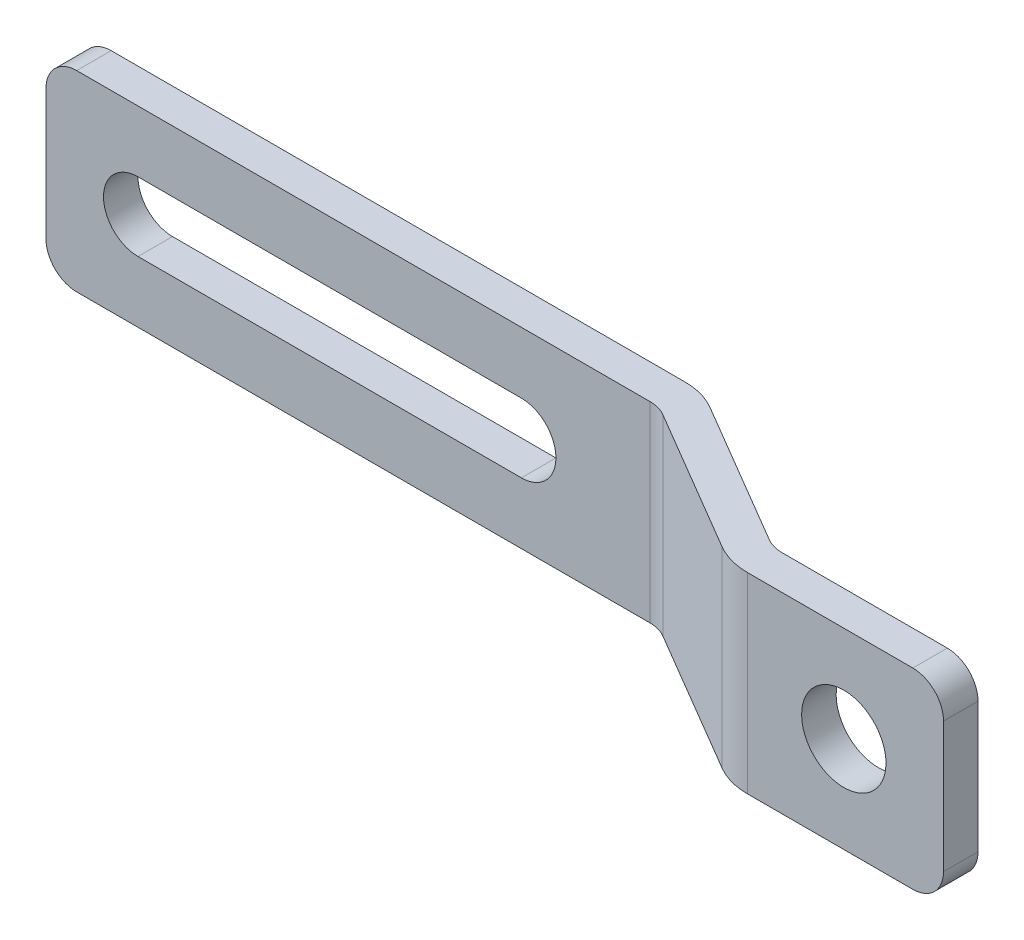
ISO-10303-21;
HEADER;
FILE_DESCRIPTION(('STEP AP214'),'2;1');
FILE_NAME('part.step','',(''),(''),'','','');
FILE_SCHEMA(('AUTOMOTIVE_DESIGN { 1 0 10303 214 1 1 1 1 }'));
ENDSEC;
DATA;
#1=APPLICATION_CONTEXT('core data for automotive mechanical design processes');
#2=APPLICATION_PROTOCOL_DEFINITION('international standard','automotive_design',2000,#1);
#3=PRODUCT_CONTEXT('',#1,'mechanical');
#4=PRODUCT('Part','Part','',(#3));
#5=PRODUCT_RELATED_PRODUCT_CATEGORY('part','',(#4));
#6=PRODUCT_DEFINITION_FORMATION('','',#4);
#7=PRODUCT_DEFINITION_CONTEXT('part definition',#1,'design');
#8=PRODUCT_DEFINITION('design','',#6,#7);
#9=PRODUCT_DEFINITION_SHAPE('','',#8);
#10=(LENGTH_UNIT() NAMED_UNIT(*) SI_UNIT(.MILLI.,.METRE.));
#11=(NAMED_UNIT(*) PLANE_ANGLE_UNIT() SI_UNIT($,.RADIAN.));
#12=(NAMED_UNIT(*) SI_UNIT($,.STERADIAN.) SOLID_ANGLE_UNIT());
#13=UNCERTAINTY_MEASURE_WITH_UNIT(LENGTH_MEASURE(1.E-05),#10,'distance_accuracy_value','');
#14=(GEOMETRIC_REPRESENTATION_CONTEXT(3) GLOBAL_UNCERTAINTY_ASSIGNED_CONTEXT((#13)) GLOBAL_UNIT_ASSIGNED_CONTEXT((#10,
#11,#12)) REPRESENTATION_CONTEXT('',''));
#15=CARTESIAN_POINT('',(0.,0.,0.));
#16=DIRECTION('',(0.,0.,1.));
#17=DIRECTION('',(1.,0.,0.));
#18=AXIS2_PLACEMENT_3D('',#15,#16,#17);
#19=CARTESIAN_POINT('',(16.7735810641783,12.5,4.5));
#20=DIRECTION('',(0.,0.,1.));
#21=DIRECTION('',(1.,0.,0.));
#22=AXIS2_PLACEMENT_3D('',#19,#20,#21);
#23=PLANE('',#22);
#24=DIRECTION('',(-1.,0.,0.));
#25=VECTOR('',#24,1.);
#26=CARTESIAN_POINT('',(16.7735810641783,12.5,4.5));
#27=LINE('',#26,#25);
#28=CARTESIAN_POINT('',(16.7735810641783,12.5,4.5));
#29=VERTEX_POINT('',#28);
#30=CARTESIAN_POINT('',(-58.,12.5,4.5));
#31=VERTEX_POINT('',#30);
#32=EDGE_CURVE('E224',#29,#31,#27,.T.);
#33=ORIENTED_EDGE('',*,*,#32,.T.);
#34=CARTESIAN_POINT('',(-58.,8.5,4.5));
#35=DIRECTION('',(0.,0.,1.));
#36=DIRECTION('',(1.,0.,0.));
#37=AXIS2_PLACEMENT_3D('',#34,#35,#36);
#38=CIRCLE('',#37,4.);
#39=CARTESIAN_POINT('',(-62.,8.5,4.5));
#40=VERTEX_POINT('',#39);
#41=EDGE_CURVE('E290',#31,#40,#38,.T.);
#42=ORIENTED_EDGE('',*,*,#41,.T.);
#43=DIRECTION('',(0.,-1.,0.));
#44=VECTOR('',#43,1.);
#45=CARTESIAN_POINT('',(-62.,12.5,4.5));
#46=LINE('',#45,#44);
#47=CARTESIAN_POINT('',(-62.,-8.5,4.5));
#48=VERTEX_POINT('',#47);
#49=EDGE_CURVE('E278',#40,#48,#46,.T.);
#50=ORIENTED_EDGE('',*,*,#49,.T.);
#51=CARTESIAN_POINT('',(-58.,-8.5,4.5));
#52=DIRECTION('',(0.,0.,1.));
#53=DIRECTION('',(1.,0.,0.));
#54=AXIS2_PLACEMENT_3D('',#51,#52,#53);
#55=CIRCLE('',#54,4.);
#56=CARTESIAN_POINT('',(-58.,-12.5,4.5));
#57=VERTEX_POINT('',#56);
#58=EDGE_CURVE('E288',#48,#57,#55,.T.);
#59=ORIENTED_EDGE('',*,*,#58,.T.);
#60=DIRECTION('',(-1.,0.,0.));
#61=VECTOR('',#60,1.);
#62=CARTESIAN_POINT('',(16.7735810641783,-12.5,4.5));
#63=LINE('',#62,#61);
#64=CARTESIAN_POINT('',(16.7735810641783,-12.5,4.5));
#65=VERTEX_POINT('',#64);
#66=EDGE_CURVE('E196',#65,#57,#63,.T.);
#67=ORIENTED_EDGE('',*,*,#66,.F.);
#68=DIRECTION('',(0.,-1.,0.));
#69=VECTOR('',#68,1.);
#70=CARTESIAN_POINT('',(16.7735810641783,12.5,4.5));
#71=LINE('',#70,#69);
#72=EDGE_CURVE('E276',#29,#65,#71,.T.);
#73=ORIENTED_EDGE('',*,*,#72,.F.);
#74=EDGE_LOOP('',(#33,#42,#50,#59,#67,#73));
#75=FACE_BOUND('',#74,.T.);
#76=DIRECTION('',(1.,0.,0.));
#77=VECTOR('',#76,1.);
#78=CARTESIAN_POINT('',(16.7735810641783,-4.5,4.5));
#79=LINE('',#78,#77);
#80=CARTESIAN_POINT('',(-50.,-4.5,4.5));
#81=VERTEX_POINT('',#80);
#82=CARTESIAN_POINT('',(0.,-4.5,4.5));
#83=VERTEX_POINT('',#82);
#84=EDGE_CURVE('E163',#81,#83,#79,.T.);
#85=ORIENTED_EDGE('',*,*,#84,.F.);
#86=CARTESIAN_POINT('',(-50.,0.,4.5));
#87=DIRECTION('',(0.,0.,1.));
#88=DIRECTION('',(1.,0.,0.));
#89=AXIS2_PLACEMENT_3D('',#86,#87,#88);
#90=CIRCLE('',#89,4.5);
#91=CARTESIAN_POINT('',(-50.,4.5,4.5));
#92=VERTEX_POINT('',#91);
#93=EDGE_CURVE('E190',#81,#92,#90,.F.);
#94=ORIENTED_EDGE('',*,*,#93,.T.);
#95=DIRECTION('',(1.,0.,0.));
#96=VECTOR('',#95,1.);
#97=CARTESIAN_POINT('',(16.7735810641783,4.5,4.5));
#98=LINE('',#97,#96);
#99=CARTESIAN_POINT('',(0.,4.5,4.5));
#100=VERTEX_POINT('',#99);
#101=EDGE_CURVE('E159',#92,#100,#98,.T.);
#102=ORIENTED_EDGE('',*,*,#101,.T.);
#103=CARTESIAN_POINT('',(0.,0.,4.5));
#104=DIRECTION('',(0.,0.,1.));
#105=DIRECTION('',(1.,0.,0.));
#106=AXIS2_PLACEMENT_3D('',#103,#104,#105);
#107=CIRCLE('',#106,4.5);
#108=EDGE_CURVE('E187',#83,#100,#107,.T.);
#109=ORIENTED_EDGE('',*,*,#108,.F.);
#110=EDGE_LOOP('',(#85,#94,#102,#109));
#111=FACE_BOUND('',#110,.T.);
#112=ADVANCED_FACE('F14',(#75,#111),#23,.T.);
#113=CARTESIAN_POINT('',(16.7735810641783,12.5,0.));
#114=DIRECTION('',(0.,0.,1.));
#115=DIRECTION('',(1.,0.,0.));
#116=AXIS2_PLACEMENT_3D('',#113,#114,#115);
#117=PLANE('',#116);
#118=DIRECTION('',(0.,-1.,0.));
#119=VECTOR('',#118,1.);
#120=CARTESIAN_POINT('',(-62.,12.5,0.));
#121=LINE('',#120,#119);
#122=CARTESIAN_POINT('',(-62.,8.5,0.));
#123=VERTEX_POINT('',#122);
#124=CARTESIAN_POINT('',(-62.,-8.5,0.));
#125=VERTEX_POINT('',#124);
#126=EDGE_CURVE('E252',#123,#125,#121,.T.);
#127=ORIENTED_EDGE('',*,*,#126,.F.);
#128=CARTESIAN_POINT('',(-58.,8.5,0.));
#129=DIRECTION('',(0.,0.,1.));
#130=DIRECTION('',(1.,0.,0.));
#131=AXIS2_PLACEMENT_3D('',#128,#129,#130);
#132=CIRCLE('',#131,4.);
#133=CARTESIAN_POINT('',(-58.,12.5,0.));
#134=VERTEX_POINT('',#133);
#135=EDGE_CURVE('E299',#123,#134,#132,.F.);
#136=ORIENTED_EDGE('',*,*,#135,.T.);
#137=DIRECTION('',(-1.,0.,0.));
#138=VECTOR('',#137,1.);
#139=CARTESIAN_POINT('',(16.7735810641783,12.5,0.));
#140=LINE('',#139,#138);
#141=CARTESIAN_POINT('',(16.7735810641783,12.5,0.));
#142=VERTEX_POINT('',#141);
#143=EDGE_CURVE('E249',#142,#134,#140,.T.);
#144=ORIENTED_EDGE('',*,*,#143,.F.);
#145=DIRECTION('',(0.,-1.,0.));
#146=VECTOR('',#145,1.);
#147=CARTESIAN_POINT('',(16.7735810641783,12.5,0.));
#148=LINE('',#147,#146);
#149=CARTESIAN_POINT('',(16.7735810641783,-12.5,0.));
#150=VERTEX_POINT('',#149);
#151=EDGE_CURVE('E255',#142,#150,#148,.T.);
#152=ORIENTED_EDGE('',*,*,#151,.T.);
#153=DIRECTION('',(-1.,0.,0.));
#154=VECTOR('',#153,1.);
#155=CARTESIAN_POINT('',(16.7735810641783,-12.5,0.));
#156=LINE('',#155,#154);
#157=CARTESIAN_POINT('',(-58.,-12.5,0.));
#158=VERTEX_POINT('',#157);
#159=EDGE_CURVE('E221',#150,#158,#156,.T.);
#160=ORIENTED_EDGE('',*,*,#159,.T.);
#161=CARTESIAN_POINT('',(-58.,-8.5,0.));
#162=DIRECTION('',(0.,0.,1.));
#163=DIRECTION('',(1.,0.,0.));
#164=AXIS2_PLACEMENT_3D('',#161,#162,#163);
#165=CIRCLE('',#164,4.);
#166=EDGE_CURVE('E297',#158,#125,#165,.F.);
#167=ORIENTED_EDGE('',*,*,#166,.T.);
#168=EDGE_LOOP('',(#127,#136,#144,#152,#160,#167));
#169=FACE_BOUND('',#168,.T.);
#170=CARTESIAN_POINT('',(-50.,0.,0.));
#171=DIRECTION('',(0.,0.,-1.));
#172=DIRECTION('',(0.,-1.,0.));
#173=AXIS2_PLACEMENT_3D('',#170,#171,#172);
#174=CIRCLE('',#173,4.5);
#175=CARTESIAN_POINT('',(-50.,-4.5,0.));
#176=VERTEX_POINT('',#175);
#177=CARTESIAN_POINT('',(-50.,4.5,0.));
#178=VERTEX_POINT('',#177);
#179=EDGE_CURVE('E167',#176,#178,#174,.T.);
#180=ORIENTED_EDGE('',*,*,#179,.F.);
#181=DIRECTION('',(1.,0.,0.));
#182=VECTOR('',#181,1.);
#183=CARTESIAN_POINT('',(-50.,-4.5,0.));
#184=LINE('',#183,#182);
#185=CARTESIAN_POINT('',(0.,-4.5,0.));
#186=VERTEX_POINT('',#185);
#187=EDGE_CURVE('E177',#176,#186,#184,.T.);
#188=ORIENTED_EDGE('',*,*,#187,.T.);
#189=CARTESIAN_POINT('',(0.,0.,0.));
#190=DIRECTION('',(0.,0.,1.));
#191=DIRECTION('',(0.,1.,0.));
#192=AXIS2_PLACEMENT_3D('',#189,#190,#191);
#193=CIRCLE('',#192,4.5);
#194=CARTESIAN_POINT('',(0.,4.5,0.));
#195=VERTEX_POINT('',#194);
#196=EDGE_CURVE('E175',#186,#195,#193,.T.);
#197=ORIENTED_EDGE('',*,*,#196,.T.);
#198=DIRECTION('',(1.,0.,0.));
#199=VECTOR('',#198,1.);
#200=CARTESIAN_POINT('',(-50.,4.5,0.));
#201=LINE('',#200,#199);
#202=EDGE_CURVE('E156',#178,#195,#201,.T.);
#203=ORIENTED_EDGE('',*,*,#202,.F.);
#204=EDGE_LOOP('',(#180,#188,#197,#203));
#205=FACE_BOUND('',#204,.T.);
#206=ADVANCED_FACE('F174',(#169,#205),#117,.F.);
#207=CARTESIAN_POINT('',(-62.,12.5,0.));
#208=DIRECTION('',(1.,0.,0.));
#209=DIRECTION('',(0.,0.,-1.));
#210=AXIS2_PLACEMENT_3D('',#207,#208,#209);
#211=PLANE('',#210);
#212=ORIENTED_EDGE('',*,*,#49,.F.);
#213=DIRECTION('',(0.,0.,1.));
#214=VECTOR('',#213,1.);
#215=CARTESIAN_POINT('',(-62.,8.5,8.99999999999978));
#216=LINE('',#215,#214);
#217=EDGE_CURVE('E295',#40,#123,#216,.F.);
#218=ORIENTED_EDGE('',*,*,#217,.T.);
#219=ORIENTED_EDGE('',*,*,#126,.T.);
#220=DIRECTION('',(0.,0.,1.));
#221=VECTOR('',#220,1.);
#222=CARTESIAN_POINT('',(-62.,-8.5,0.));
#223=LINE('',#222,#221);
#224=EDGE_CURVE('E292',#125,#48,#223,.T.);
#225=ORIENTED_EDGE('',*,*,#224,.T.);
#226=EDGE_LOOP('',(#212,#218,#219,#225));
#227=FACE_BOUND('',#226,.T.);
#228=ADVANCED_FACE('F326',(#227),#211,.F.);
#229=CARTESIAN_POINT('',(16.7735810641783,12.5,9.));
#230=DIRECTION('',(0.,-1.,0.));
#231=DIRECTION('',(1.,0.,0.));
#232=AXIS2_PLACEMENT_3D('',#229,#230,#231);
#233=CYLINDRICAL_SURFACE('',#232,4.5);
#234=DIRECTION('',(0.,-1.,0.));
#235=VECTOR('',#234,1.);
#236=CARTESIAN_POINT('',(19.0568269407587,12.5,5.12227021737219));
#237=LINE('',#236,#235);
#238=CARTESIAN_POINT('',(19.0568269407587,12.5,5.12227021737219));
#239=VERTEX_POINT('',#238);
#240=CARTESIAN_POINT('',(19.0568269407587,-12.5,5.12227021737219));
#241=VERTEX_POINT('',#240);
#242=EDGE_CURVE('E274',#239,#241,#237,.T.);
#243=ORIENTED_EDGE('',*,*,#242,.F.);
#244=CARTESIAN_POINT('',(16.7735810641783,12.5,9.));
#245=DIRECTION('',(0.,1.,0.));
#246=DIRECTION('',(-1.,0.,0.));
#247=AXIS2_PLACEMENT_3D('',#244,#245,#246);
#248=CIRCLE('',#247,4.5);
#249=EDGE_CURVE('E227',#239,#29,#248,.T.);
#250=ORIENTED_EDGE('',*,*,#249,.T.);
#251=ORIENTED_EDGE('',*,*,#72,.T.);
#252=CARTESIAN_POINT('',(16.7735810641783,-12.5,9.));
#253=DIRECTION('',(0.,1.,0.));
#254=DIRECTION('',(-1.,0.,0.));
#255=AXIS2_PLACEMENT_3D('',#252,#253,#254);
#256=CIRCLE('',#255,4.5);
#257=EDGE_CURVE('E199',#241,#65,#256,.T.);
#258=ORIENTED_EDGE('',*,*,#257,.F.);
#259=EDGE_LOOP('',(#243,#250,#251,#258));
#260=FACE_BOUND('',#259,.T.);
#261=ADVANCED_FACE('F377',(#260),#233,.F.);
#262=CARTESIAN_POINT('',(37.8863461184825,12.5,16.2092784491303));
#263=DIRECTION('',(-0.507387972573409,0.,0.861717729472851));
#264=DIRECTION('',(0.861717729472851,0.,0.507387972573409));
#265=AXIS2_PLACEMENT_3D('',#262,#263,#264);
#266=PLANE('',#265);
#267=DIRECTION('',(0.,-1.,0.));
#268=VECTOR('',#267,1.);
#269=CARTESIAN_POINT('',(37.8863461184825,12.5,16.2092784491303));
#270=LINE('',#269,#268);
#271=CARTESIAN_POINT('',(37.8863461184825,12.5,16.2092784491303));
#272=VERTEX_POINT('',#271);
#273=CARTESIAN_POINT('',(37.8863461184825,-12.5,16.2092784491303));
#274=VERTEX_POINT('',#273);
#275=EDGE_CURVE('E272',#272,#274,#270,.T.);
#276=ORIENTED_EDGE('',*,*,#275,.F.);
#277=DIRECTION('',(-0.861717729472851,0.,-0.507387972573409));
#278=VECTOR('',#277,1.);
#279=CARTESIAN_POINT('',(37.8863461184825,12.5,16.2092784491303));
#280=LINE('',#279,#278);
#281=EDGE_CURVE('E230',#272,#239,#280,.T.);
#282=ORIENTED_EDGE('',*,*,#281,.T.);
#283=ORIENTED_EDGE('',*,*,#242,.T.);
#284=DIRECTION('',(-0.861717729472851,0.,-0.507387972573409));
#285=VECTOR('',#284,1.);
#286=CARTESIAN_POINT('',(37.8863461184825,-12.5,16.2092784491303));
#287=LINE('',#286,#285);
#288=EDGE_CURVE('E202',#274,#241,#287,.T.);
#289=ORIENTED_EDGE('',*,*,#288,.F.);
#290=EDGE_LOOP('',(#276,#282,#283,#289));
#291=FACE_BOUND('',#290,.T.);
#292=ADVANCED_FACE('F374',(#291),#266,.T.);
#293=CARTESIAN_POINT('',(42.4528378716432,12.5,8.45381888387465));
#294=DIRECTION('',(0.,-1.,0.));
#295=DIRECTION('',(1.,0.,0.));
#296=AXIS2_PLACEMENT_3D('',#293,#294,#295);
#297=CYLINDRICAL_SURFACE('',#296,9.);
#298=DIRECTION('',(0.,-1.,0.));
#299=VECTOR('',#298,1.);
#300=CARTESIAN_POINT('',(42.4528378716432,12.5,17.4538188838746));
#301=LINE('',#300,#299);
#302=CARTESIAN_POINT('',(42.4528378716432,12.5,17.4538188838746));
#303=VERTEX_POINT('',#302);
#304=CARTESIAN_POINT('',(42.4528378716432,-12.5,17.4538188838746));
#305=VERTEX_POINT('',#304);
#306=EDGE_CURVE('E269',#303,#305,#301,.T.);
#307=ORIENTED_EDGE('',*,*,#306,.F.);
#308=CARTESIAN_POINT('',(42.4528378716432,12.5,8.45381888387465));
#309=DIRECTION('',(0.,-1.,0.));
#310=DIRECTION('',(1.,0.,0.));
#311=AXIS2_PLACEMENT_3D('',#308,#309,#310);
#312=CIRCLE('',#311,9.);
#313=EDGE_CURVE('E233',#303,#272,#312,.T.);
#314=ORIENTED_EDGE('',*,*,#313,.T.);
#315=ORIENTED_EDGE('',*,*,#275,.T.);
#316=CARTESIAN_POINT('',(42.4528378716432,-12.5,8.45381888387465));
#317=DIRECTION('',(0.,-1.,0.));
#318=DIRECTION('',(1.,0.,0.));
#319=AXIS2_PLACEMENT_3D('',#316,#317,#318);
#320=CIRCLE('',#319,9.);
#321=EDGE_CURVE('E205',#305,#274,#320,.T.);
#322=ORIENTED_EDGE('',*,*,#321,.F.);
#323=EDGE_LOOP('',(#307,#314,#315,#322));
#324=FACE_BOUND('',#323,.T.);
#325=ADVANCED_FACE('F370',(#324),#297,.T.);
#326=CARTESIAN_POINT('',(68.,12.5,17.4538188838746));
#327=DIRECTION('',(0.,0.,1.));
#328=DIRECTION('',(0.,1.,0.));
#329=AXIS2_PLACEMENT_3D('',#326,#327,#328);
#330=PLANE('',#329);
#331=CARTESIAN_POINT('',(55.,0.,17.4538188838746));
#332=DIRECTION('',(0.,0.,1.));
#333=DIRECTION('',(0.,1.,0.));
#334=AXIS2_PLACEMENT_3D('',#331,#332,#333);
#335=CIRCLE('',#334,5.5);
#336=CARTESIAN_POINT('',(55.,5.5,17.4538188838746));
#337=VERTEX_POINT('',#336);
#338=EDGE_CURVE('E192',#337,#337,#335,.T.);
#339=ORIENTED_EDGE('',*,*,#338,.F.);
#340=EDGE_LOOP('',(#339));
#341=FACE_BOUND('',#340,.T.);
#342=DIRECTION('',(0.,-1.,0.));
#343=VECTOR('',#342,1.);
#344=CARTESIAN_POINT('',(68.,12.5,17.4538188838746));
#345=LINE('',#344,#343);
#346=CARTESIAN_POINT('',(68.,8.5,17.4538188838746));
#347=VERTEX_POINT('',#346);
#348=CARTESIAN_POINT('',(68.,-8.5,17.4538188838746));
#349=VERTEX_POINT('',#348);
#350=EDGE_CURVE('E266',#347,#349,#345,.T.);
#351=ORIENTED_EDGE('',*,*,#350,.F.);
#352=CARTESIAN_POINT('',(64.,8.5,17.4538188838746));
#353=DIRECTION('',(0.,0.,1.));
#354=DIRECTION('',(0.,1.,0.));
#355=AXIS2_PLACEMENT_3D('',#352,#353,#354);
#356=CIRCLE('',#355,4.);
#357=CARTESIAN_POINT('',(64.,12.5,17.4538188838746));
#358=VERTEX_POINT('',#357);
#359=EDGE_CURVE('E307',#347,#358,#356,.T.);
#360=ORIENTED_EDGE('',*,*,#359,.T.);
#361=DIRECTION('',(-1.,0.,0.));
#362=VECTOR('',#361,1.);
#363=CARTESIAN_POINT('',(68.,12.5,17.4538188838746));
#364=LINE('',#363,#362);
#365=EDGE_CURVE('E236',#358,#303,#364,.T.);
#366=ORIENTED_EDGE('',*,*,#365,.T.);
#367=ORIENTED_EDGE('',*,*,#306,.T.);
#368=DIRECTION('',(-1.,0.,0.));
#369=VECTOR('',#368,1.);
#370=CARTESIAN_POINT('',(68.,-12.5,17.4538188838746));
#371=LINE('',#370,#369);
#372=CARTESIAN_POINT('',(64.,-12.5,17.4538188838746));
#373=VERTEX_POINT('',#372);
#374=EDGE_CURVE('E208',#373,#305,#371,.T.);
#375=ORIENTED_EDGE('',*,*,#374,.F.);
#376=CARTESIAN_POINT('',(64.,-8.5,17.4538188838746));
#377=DIRECTION('',(0.,0.,1.));
#378=DIRECTION('',(0.,1.,0.));
#379=AXIS2_PLACEMENT_3D('',#376,#377,#378);
#380=CIRCLE('',#379,4.);
#381=EDGE_CURVE('E36',#373,#349,#380,.T.);
#382=ORIENTED_EDGE('',*,*,#381,.T.);
#383=EDGE_LOOP('',(#351,#360,#366,#367,#375,#382));
#384=FACE_BOUND('',#383,.T.);
#385=ADVANCED_FACE('F364',(#341,#384),#330,.T.);
#386=CARTESIAN_POINT('',(68.,12.5,12.9538188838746));
#387=DIRECTION('',(1.,0.,0.));
#388=DIRECTION('',(0.,1.,0.));
#389=AXIS2_PLACEMENT_3D('',#386,#387,#388);
#390=PLANE('',#389);
#391=DIRECTION('',(0.,-1.,0.));
#392=VECTOR('',#391,1.);
#393=CARTESIAN_POINT('',(68.,12.5,12.9538188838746));
#394=LINE('',#393,#392);
#395=CARTESIAN_POINT('',(68.,8.5,12.9538188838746));
#396=VERTEX_POINT('',#395);
#397=CARTESIAN_POINT('',(68.,-8.5,12.9538188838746));
#398=VERTEX_POINT('',#397);
#399=EDGE_CURVE('E264',#396,#398,#394,.T.);
#400=ORIENTED_EDGE('',*,*,#399,.F.);
#401=DIRECTION('',(0.,0.,1.));
#402=VECTOR('',#401,1.);
#403=CARTESIAN_POINT('',(68.,8.5,12.9538188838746));
#404=LINE('',#403,#402);
#405=EDGE_CURVE('E303',#396,#347,#404,.T.);
#406=ORIENTED_EDGE('',*,*,#405,.T.);
#407=ORIENTED_EDGE('',*,*,#350,.T.);
#408=DIRECTION('',(0.,0.,1.));
#409=VECTOR('',#408,1.);
#410=CARTESIAN_POINT('',(68.,-8.5,9.));
#411=LINE('',#410,#409);
#412=EDGE_CURVE('E301',#349,#398,#411,.F.);
#413=ORIENTED_EDGE('',*,*,#412,.T.);
#414=EDGE_LOOP('',(#400,#406,#407,#413));
#415=FACE_BOUND('',#414,.T.);
#416=ADVANCED_FACE('F357',(#415),#390,.T.);
#417=CARTESIAN_POINT('',(68.,12.5,12.9538188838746));
#418=DIRECTION('',(0.,0.,1.));
#419=DIRECTION('',(0.,1.,0.));
#420=AXIS2_PLACEMENT_3D('',#417,#418,#419);
#421=PLANE('',#420);
#422=CARTESIAN_POINT('',(55.,0.,12.9538188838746));
#423=DIRECTION('',(0.,0.,1.));
#424=DIRECTION('',(0.,1.,0.));
#425=AXIS2_PLACEMENT_3D('',#422,#423,#424);
#426=CIRCLE('',#425,5.5);
#427=CARTESIAN_POINT('',(55.,5.5,12.9538188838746));
#428=VERTEX_POINT('',#427);
#429=EDGE_CURVE('E195',#428,#428,#426,.T.);
#430=ORIENTED_EDGE('',*,*,#429,.T.);
#431=EDGE_LOOP('',(#430));
#432=FACE_BOUND('',#431,.T.);
#433=DIRECTION('',(-1.,0.,0.));
#434=VECTOR('',#433,1.);
#435=CARTESIAN_POINT('',(68.,12.5,12.9538188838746));
#436=LINE('',#435,#434);
#437=CARTESIAN_POINT('',(64.,12.5,12.9538188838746));
#438=VERTEX_POINT('',#437);
#439=CARTESIAN_POINT('',(42.4528378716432,12.5,12.9538188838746));
#440=VERTEX_POINT('',#439);
#441=EDGE_CURVE('E238',#438,#440,#436,.T.);
#442=ORIENTED_EDGE('',*,*,#441,.F.);
#443=CARTESIAN_POINT('',(64.,8.5,12.9538188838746));
#444=DIRECTION('',(0.,0.,1.));
#445=DIRECTION('',(0.,1.,0.));
#446=AXIS2_PLACEMENT_3D('',#443,#444,#445);
#447=CIRCLE('',#446,4.);
#448=EDGE_CURVE('E310',#438,#396,#447,.F.);
#449=ORIENTED_EDGE('',*,*,#448,.T.);
#450=ORIENTED_EDGE('',*,*,#399,.T.);
#451=CARTESIAN_POINT('',(64.,-8.5,12.9538188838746));
#452=DIRECTION('',(0.,0.,1.));
#453=DIRECTION('',(0.,1.,0.));
#454=AXIS2_PLACEMENT_3D('',#451,#452,#453);
#455=CIRCLE('',#454,4.);
#456=CARTESIAN_POINT('',(64.,-12.5,12.9538188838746));
#457=VERTEX_POINT('',#456);
#458=EDGE_CURVE('E28',#398,#457,#455,.F.);
#459=ORIENTED_EDGE('',*,*,#458,.T.);
#460=DIRECTION('',(-1.,0.,0.));
#461=VECTOR('',#460,1.);
#462=CARTESIAN_POINT('',(68.,-12.5,12.9538188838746));
#463=LINE('',#462,#461);
#464=CARTESIAN_POINT('',(42.4528378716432,-12.5,12.9538188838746));
#465=VERTEX_POINT('',#464);
#466=EDGE_CURVE('E210',#457,#465,#463,.T.);
#467=ORIENTED_EDGE('',*,*,#466,.T.);
#468=DIRECTION('',(0.,-1.,0.));
#469=VECTOR('',#468,1.);
#470=CARTESIAN_POINT('',(42.4528378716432,12.5,12.9538188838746));
#471=LINE('',#470,#469);
#472=EDGE_CURVE('E261',#440,#465,#471,.T.);
#473=ORIENTED_EDGE('',*,*,#472,.F.);
#474=EDGE_LOOP('',(#442,#449,#450,#459,#467,#473));
#475=FACE_BOUND('',#474,.T.);
#476=ADVANCED_FACE('F351',(#432,#475),#421,.F.);
#477=CARTESIAN_POINT('',(42.4528378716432,12.5,8.45381888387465));
#478=DIRECTION('',(0.,-1.,0.));
#479=DIRECTION('',(1.,0.,0.));
#480=AXIS2_PLACEMENT_3D('',#477,#478,#479);
#481=CYLINDRICAL_SURFACE('',#480,4.5);
#482=DIRECTION('',(0.,-1.,0.));
#483=VECTOR('',#482,1.);
#484=CARTESIAN_POINT('',(40.1695919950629,12.5,12.3315486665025));
#485=LINE('',#484,#483);
#486=CARTESIAN_POINT('',(40.1695919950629,12.5,12.3315486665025));
#487=VERTEX_POINT('',#486);
#488=CARTESIAN_POINT('',(40.1695919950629,-12.5,12.3315486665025));
#489=VERTEX_POINT('',#488);
#490=EDGE_CURVE('E259',#487,#489,#485,.T.);
#491=ORIENTED_EDGE('',*,*,#490,.F.);
#492=CARTESIAN_POINT('',(42.4528378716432,12.5,8.45381888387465));
#493=DIRECTION('',(0.,1.,0.));
#494=DIRECTION('',(-1.,0.,0.));
#495=AXIS2_PLACEMENT_3D('',#492,#493,#494);
#496=CIRCLE('',#495,4.5);
#497=EDGE_CURVE('E240',#440,#487,#496,.F.);
#498=ORIENTED_EDGE('',*,*,#497,.F.);
#499=ORIENTED_EDGE('',*,*,#472,.T.);
#500=CARTESIAN_POINT('',(42.4528378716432,-12.5,8.45381888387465));
#501=DIRECTION('',(0.,1.,0.));
#502=DIRECTION('',(-1.,0.,0.));
#503=AXIS2_PLACEMENT_3D('',#500,#501,#502);
#504=CIRCLE('',#503,4.5);
#505=EDGE_CURVE('E212',#465,#489,#504,.F.);
#506=ORIENTED_EDGE('',*,*,#505,.T.);
#507=EDGE_LOOP('',(#491,#498,#499,#506));
#508=FACE_BOUND('',#507,.T.);
#509=ADVANCED_FACE('F348',(#508),#481,.F.);
#510=CARTESIAN_POINT('',(40.1695919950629,12.5,12.3315486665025));
#511=DIRECTION('',(-0.507387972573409,0.,0.861717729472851));
#512=DIRECTION('',(0.861717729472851,0.,0.507387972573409));
#513=AXIS2_PLACEMENT_3D('',#510,#511,#512);
#514=PLANE('',#513);
#515=DIRECTION('',(0.,-1.,0.));
#516=VECTOR('',#515,1.);
#517=CARTESIAN_POINT('',(21.340072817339,12.5,1.24454043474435));
#518=LINE('',#517,#516);
#519=CARTESIAN_POINT('',(21.340072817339,12.5,1.24454043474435));
#520=VERTEX_POINT('',#519);
#521=CARTESIAN_POINT('',(21.340072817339,-12.5,1.24454043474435));
#522=VERTEX_POINT('',#521);
#523=EDGE_CURVE('E257',#520,#522,#518,.T.);
#524=ORIENTED_EDGE('',*,*,#523,.F.);
#525=DIRECTION('',(-0.861717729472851,0.,-0.507387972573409));
#526=VECTOR('',#525,1.);
#527=CARTESIAN_POINT('',(40.1695919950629,12.5,12.3315486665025));
#528=LINE('',#527,#526);
#529=EDGE_CURVE('E243',#487,#520,#528,.T.);
#530=ORIENTED_EDGE('',*,*,#529,.F.);
#531=ORIENTED_EDGE('',*,*,#490,.T.);
#532=DIRECTION('',(-0.861717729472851,0.,-0.507387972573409));
#533=VECTOR('',#532,1.);
#534=CARTESIAN_POINT('',(40.1695919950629,-12.5,12.3315486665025));
#535=LINE('',#534,#533);
#536=EDGE_CURVE('E215',#489,#522,#535,.T.);
#537=ORIENTED_EDGE('',*,*,#536,.T.);
#538=EDGE_LOOP('',(#524,#530,#531,#537));
#539=FACE_BOUND('',#538,.T.);
#540=ADVANCED_FACE('F345',(#539),#514,.F.);
#541=CARTESIAN_POINT('',(16.7735810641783,12.5,9.));
#542=DIRECTION('',(0.,-1.,0.));
#543=DIRECTION('',(1.,0.,0.));
#544=AXIS2_PLACEMENT_3D('',#541,#542,#543);
#545=CYLINDRICAL_SURFACE('',#544,9.);
#546=ORIENTED_EDGE('',*,*,#151,.F.);
#547=CARTESIAN_POINT('',(16.7735810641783,12.5,9.));
#548=DIRECTION('',(0.,1.,0.));
#549=DIRECTION('',(-1.,0.,0.));
#550=AXIS2_PLACEMENT_3D('',#547,#548,#549);
#551=CIRCLE('',#550,9.);
#552=EDGE_CURVE('E246',#520,#142,#551,.T.);
#553=ORIENTED_EDGE('',*,*,#552,.F.);
#554=ORIENTED_EDGE('',*,*,#523,.T.);
#555=CARTESIAN_POINT('',(16.7735810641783,-12.5,9.));
#556=DIRECTION('',(0.,1.,0.));
#557=DIRECTION('',(-1.,0.,0.));
#558=AXIS2_PLACEMENT_3D('',#555,#556,#557);
#559=CIRCLE('',#558,9.);
#560=EDGE_CURVE('E218',#522,#150,#559,.T.);
#561=ORIENTED_EDGE('',*,*,#560,.T.);
#562=EDGE_LOOP('',(#546,#553,#554,#561));
#563=FACE_BOUND('',#562,.T.);
#564=ADVANCED_FACE('F341',(#563),#545,.T.);
#565=CARTESIAN_POINT('',(16.7735810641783,12.5,9.));
#566=DIRECTION('',(0.,1.,0.));
#567=DIRECTION('',(-1.,0.,0.));
#568=AXIS2_PLACEMENT_3D('',#565,#566,#567);
#569=PLANE('',#568);
#570=ORIENTED_EDGE('',*,*,#143,.T.);
#571=DIRECTION('',(0.,0.,1.));
#572=VECTOR('',#571,1.);
#573=CARTESIAN_POINT('',(-58.,12.5,8.99999999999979));
#574=LINE('',#573,#572);
#575=EDGE_CURVE('E285',#134,#31,#574,.T.);
#576=ORIENTED_EDGE('',*,*,#575,.T.);
#577=ORIENTED_EDGE('',*,*,#32,.F.);
#578=ORIENTED_EDGE('',*,*,#249,.F.);
#579=ORIENTED_EDGE('',*,*,#281,.F.);
#580=ORIENTED_EDGE('',*,*,#313,.F.);
#581=ORIENTED_EDGE('',*,*,#365,.F.);
#582=DIRECTION('',(0.,0.,1.));
#583=VECTOR('',#582,1.);
#584=CARTESIAN_POINT('',(64.,12.5,9.));
#585=LINE('',#584,#583);
#586=EDGE_CURVE('E281',#358,#438,#585,.F.);
#587=ORIENTED_EDGE('',*,*,#586,.T.);
#588=ORIENTED_EDGE('',*,*,#441,.T.);
#589=ORIENTED_EDGE('',*,*,#497,.T.);
#590=ORIENTED_EDGE('',*,*,#529,.T.);
#591=ORIENTED_EDGE('',*,*,#552,.T.);
#592=EDGE_LOOP('',(#570,#576,#577,#578,#579,#580,#581,#587,#588,#589,#590,#591));
#593=FACE_BOUND('',#592,.T.);
#594=ADVANCED_FACE('F336',(#593),#569,.T.);
#595=CARTESIAN_POINT('',(16.7735810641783,-12.5,9.));
#596=DIRECTION('',(0.,1.,0.));
#597=DIRECTION('',(-1.,0.,0.));
#598=AXIS2_PLACEMENT_3D('',#595,#596,#597);
#599=PLANE('',#598);
#600=ORIENTED_EDGE('',*,*,#466,.F.);
#601=DIRECTION('',(0.,0.,1.));
#602=VECTOR('',#601,1.);
#603=CARTESIAN_POINT('',(64.,-12.5,9.));
#604=LINE('',#603,#602);
#605=EDGE_CURVE('E9',#457,#373,#604,.T.);
#606=ORIENTED_EDGE('',*,*,#605,.T.);
#607=ORIENTED_EDGE('',*,*,#374,.T.);
#608=ORIENTED_EDGE('',*,*,#321,.T.);
#609=ORIENTED_EDGE('',*,*,#288,.T.);
#610=ORIENTED_EDGE('',*,*,#257,.T.);
#611=ORIENTED_EDGE('',*,*,#66,.T.);
#612=DIRECTION('',(0.,0.,1.));
#613=VECTOR('',#612,1.);
#614=CARTESIAN_POINT('',(-58.,-12.5,8.99999999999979));
#615=LINE('',#614,#613);
#616=EDGE_CURVE('E21',#57,#158,#615,.F.);
#617=ORIENTED_EDGE('',*,*,#616,.T.);
#618=ORIENTED_EDGE('',*,*,#159,.F.);
#619=ORIENTED_EDGE('',*,*,#560,.F.);
#620=ORIENTED_EDGE('',*,*,#536,.F.);
#621=ORIENTED_EDGE('',*,*,#505,.F.);
#622=EDGE_LOOP('',(#600,#606,#607,#608,#609,#610,#611,#617,#618,#619,#620,#621));
#623=FACE_BOUND('',#622,.T.);
#624=ADVANCED_FACE('F314',(#623),#599,.F.);
#625=CARTESIAN_POINT('',(55.,0.,0.));
#626=DIRECTION('',(0.,0.,1.));
#627=DIRECTION('',(0.,1.,0.));
#628=AXIS2_PLACEMENT_3D('',#625,#626,#627);
#629=CYLINDRICAL_SURFACE('',#628,5.5);
#630=ORIENTED_EDGE('',*,*,#338,.T.);
#631=EDGE_LOOP('',(#630));
#632=FACE_BOUND('',#631,.T.);
#633=ORIENTED_EDGE('',*,*,#429,.F.);
#634=EDGE_LOOP('',(#633));
#635=FACE_BOUND('',#634,.T.);
#636=ADVANCED_FACE('F465',(#632,#635),#629,.F.);
#637=CARTESIAN_POINT('',(-50.,0.,0.));
#638=DIRECTION('',(0.,0.,1.));
#639=DIRECTION('',(0.,1.,0.));
#640=AXIS2_PLACEMENT_3D('',#637,#638,#639);
#641=CYLINDRICAL_SURFACE('',#640,4.5);
#642=DIRECTION('',(0.,0.,1.));
#643=VECTOR('',#642,1.);
#644=CARTESIAN_POINT('',(-50.,-4.5,0.));
#645=LINE('',#644,#643);
#646=EDGE_CURVE('E169',#176,#81,#645,.T.);
#647=ORIENTED_EDGE('',*,*,#646,.F.);
#648=ORIENTED_EDGE('',*,*,#179,.T.);
#649=DIRECTION('',(0.,0.,1.));
#650=VECTOR('',#649,1.);
#651=CARTESIAN_POINT('',(-50.,4.5,0.));
#652=LINE('',#651,#650);
#653=EDGE_CURVE('E151',#178,#92,#652,.T.);
#654=ORIENTED_EDGE('',*,*,#653,.T.);
#655=ORIENTED_EDGE('',*,*,#93,.F.);
#656=EDGE_LOOP('',(#647,#648,#654,#655));
#657=FACE_BOUND('',#656,.T.);
#658=ADVANCED_FACE('F168',(#657),#641,.F.);
#659=CARTESIAN_POINT('',(-50.,4.5,0.));
#660=DIRECTION('',(0.,-1.,0.));
#661=DIRECTION('',(1.,0.,0.));
#662=AXIS2_PLACEMENT_3D('',#659,#660,#661);
#663=PLANE('',#662);
#664=ORIENTED_EDGE('',*,*,#653,.F.);
#665=ORIENTED_EDGE('',*,*,#202,.T.);
#666=DIRECTION('',(0.,0.,1.));
#667=VECTOR('',#666,1.);
#668=CARTESIAN_POINT('',(0.,4.5,0.));
#669=LINE('',#668,#667);
#670=EDGE_CURVE('E164',#195,#100,#669,.T.);
#671=ORIENTED_EDGE('',*,*,#670,.T.);
#672=ORIENTED_EDGE('',*,*,#101,.F.);
#673=EDGE_LOOP('',(#664,#665,#671,#672));
#674=FACE_BOUND('',#673,.T.);
#675=ADVANCED_FACE('F153',(#674),#663,.T.);
#676=CARTESIAN_POINT('',(0.,0.,0.));
#677=DIRECTION('',(0.,0.,1.));
#678=DIRECTION('',(0.,1.,0.));
#679=AXIS2_PLACEMENT_3D('',#676,#677,#678);
#680=CYLINDRICAL_SURFACE('',#679,4.5);
#681=ORIENTED_EDGE('',*,*,#108,.T.);
#682=ORIENTED_EDGE('',*,*,#670,.F.);
#683=ORIENTED_EDGE('',*,*,#196,.F.);
#684=DIRECTION('',(0.,0.,1.));
#685=VECTOR('',#684,1.);
#686=CARTESIAN_POINT('',(0.,-4.5,0.));
#687=LINE('',#686,#685);
#688=EDGE_CURVE('E182',#186,#83,#687,.T.);
#689=ORIENTED_EDGE('',*,*,#688,.T.);
#690=EDGE_LOOP('',(#681,#682,#683,#689));
#691=FACE_BOUND('',#690,.T.);
#692=ADVANCED_FACE('F488',(#691),#680,.F.);
#693=CARTESIAN_POINT('',(-50.,-4.5,0.));
#694=DIRECTION('',(0.,-1.,0.));
#695=DIRECTION('',(1.,0.,0.));
#696=AXIS2_PLACEMENT_3D('',#693,#694,#695);
#697=PLANE('',#696);
#698=ORIENTED_EDGE('',*,*,#84,.T.);
#699=ORIENTED_EDGE('',*,*,#688,.F.);
#700=ORIENTED_EDGE('',*,*,#187,.F.);
#701=ORIENTED_EDGE('',*,*,#646,.T.);
#702=EDGE_LOOP('',(#698,#699,#700,#701));
#703=FACE_BOUND('',#702,.T.);
#704=ADVANCED_FACE('F496',(#703),#697,.F.);
#705=CARTESIAN_POINT('',(-58.,8.5,8.99999999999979));
#706=DIRECTION('',(0.,0.,-1.));
#707=DIRECTION('',(-1.,0.,0.));
#708=AXIS2_PLACEMENT_3D('',#705,#706,#707);
#709=CYLINDRICAL_SURFACE('',#708,4.);
#710=ORIENTED_EDGE('',*,*,#135,.F.);
#711=ORIENTED_EDGE('',*,*,#217,.F.);
#712=ORIENTED_EDGE('',*,*,#41,.F.);
#713=ORIENTED_EDGE('',*,*,#575,.F.);
#714=EDGE_LOOP('',(#710,#711,#712,#713));
#715=FACE_BOUND('',#714,.T.);
#716=ADVANCED_FACE('F334',(#715),#709,.T.);
#717=CARTESIAN_POINT('',(64.,8.5,12.9538188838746));
#718=DIRECTION('',(0.,0.,1.));
#719=DIRECTION('',(0.,1.,0.));
#720=AXIS2_PLACEMENT_3D('',#717,#718,#719);
#721=CYLINDRICAL_SURFACE('',#720,4.);
#722=ORIENTED_EDGE('',*,*,#448,.F.);
#723=ORIENTED_EDGE('',*,*,#586,.F.);
#724=ORIENTED_EDGE('',*,*,#359,.F.);
#725=ORIENTED_EDGE('',*,*,#405,.F.);
#726=EDGE_LOOP('',(#722,#723,#724,#725));
#727=FACE_BOUND('',#726,.T.);
#728=ADVANCED_FACE('F362',(#727),#721,.T.);
#729=CARTESIAN_POINT('',(64.,-8.5,9.));
#730=DIRECTION('',(0.,0.,-1.));
#731=DIRECTION('',(0.,-1.,0.));
#732=AXIS2_PLACEMENT_3D('',#729,#730,#731);
#733=CYLINDRICAL_SURFACE('',#732,4.);
#734=ORIENTED_EDGE('',*,*,#458,.F.);
#735=ORIENTED_EDGE('',*,*,#412,.F.);
#736=ORIENTED_EDGE('',*,*,#381,.F.);
#737=ORIENTED_EDGE('',*,*,#605,.F.);
#738=EDGE_LOOP('',(#734,#735,#736,#737));
#739=FACE_BOUND('',#738,.T.);
#740=ADVANCED_FACE('F354',(#739),#733,.T.);
#741=CARTESIAN_POINT('',(-58.,-8.5,0.));
#742=DIRECTION('',(0.,0.,1.));
#743=DIRECTION('',(1.,0.,0.));
#744=AXIS2_PLACEMENT_3D('',#741,#742,#743);
#745=CYLINDRICAL_SURFACE('',#744,4.);
#746=ORIENTED_EDGE('',*,*,#166,.F.);
#747=ORIENTED_EDGE('',*,*,#616,.F.);
#748=ORIENTED_EDGE('',*,*,#58,.F.);
#749=ORIENTED_EDGE('',*,*,#224,.F.);
#750=EDGE_LOOP('',(#746,#747,#748,#749));
#751=FACE_BOUND('',#750,.T.);
#752=ADVANCED_FACE('F323',(#751),#745,.T.);
#753=CLOSED_SHELL('',(#112,#206,#228,#261,#292,#325,#385,#416,#476,#509,#540,#564,#594,#624,
#636,#658,#675,#692,#704,#716,#728,#740,#752));
#754=MANIFOLD_SOLID_BREP('B1',#753);
#755=ADVANCED_BREP_SHAPE_REPRESENTATION('',(#18,#754),#14);
#756=SHAPE_DEFINITION_REPRESENTATION(#9,#755);
ENDSEC;
END-ISO-10303-21;
